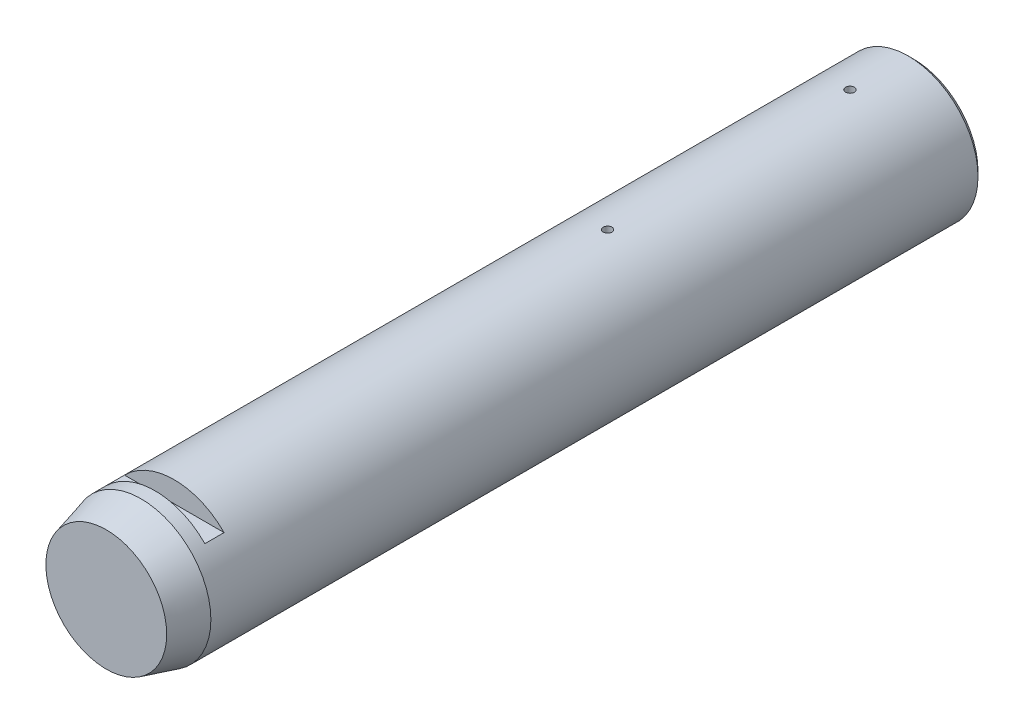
from build123d import *

# Parameters (mm, degrees)
ESQUISSE1_R                  = 40
EXTRUSION1_DEPTH             = 463
CHANFREIN1_SIZE              = 3
CHANFREIN2_SIZE              = 20
CHANFREIN2_SIZE2             = 5.358983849
TROU_TARAUD_M81_D            = 6.8
TROU_TARAUD_M81_DEPTH        = 180
TROU_TARAUD_M81_TIP          = 2.042926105
TROU_TARAUD_M82_D            = 6.8
TROU_TARAUD_M82_DEPTH        = 125
TROU_TARAUD_M82_TIP          = 2.042926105
ENL_V_MAT_EXTRU_1_REACH      = 473.991
ENL_V_MAT_EXTRU_1_END_RADIUS = 3.4
ESQUISSE6_R                  = 2.5
ENL_V_MAT_EXTRU_2_DEPTH      = 42
ENL_V_MAT_EXTRU_2_DEPTH_BACK = 42
ESQUISSE7_W                  = 11
ESQUISSE7_H                  = 17.34138166


with BuildPart() as part:
    # Esquisse1 → Extrusion1 (new body)
    with BuildSketch(Plane.XY):
        Circle(ESQUISSE1_R)
    extrude(amount=EXTRUSION1_DEPTH)

    # Chanfrein1
    chanfrein1_edges = [part.edges().sort_by_distance(p)[0] for p in [
        (-40, 0, 0),
    ]]
    chamfer(chanfrein1_edges, length=CHANFREIN1_SIZE)

    # Chanfrein2
    chanfrein2_edges = [part.edges().sort_by_distance(p)[0] for p in [
        (-40, 0, 463),
    ]]
    chanfrein2_side = [part.faces().sort_by_distance(p)[0] for p in [
        (-40, 0, 233),
    ]]
    chamfer(chanfrein2_edges, length=CHANFREIN2_SIZE, length2=CHANFREIN2_SIZE2, reference=chanfrein2_side[0])

    # Trou taraud_ M81
    with Locations(Plane(origin=(0, 0, 0), x_dir=(-1, 0, 0), z_dir=(0, 0, -1))):
        with Locations((0, 0)):
            Hole(TROU_TARAUD_M81_D / 2, depth=TROU_TARAUD_M81_DEPTH)
            with Locations((0, 0, -(TROU_TARAUD_M81_DEPTH + TROU_TARAUD_M81_TIP / 2))):  # 118° drill point
                Cone(0, TROU_TARAUD_M81_D / 2, TROU_TARAUD_M81_TIP, mode=Mode.SUBTRACT)

    # Trou taraud_ M82
    with Locations(Plane(origin=(0, 0, 0), x_dir=(-1, 0, 0), z_dir=(0, 0, -1))):
        with Locations((-25, 0), (25, 0)):
            Hole(TROU_TARAUD_M82_D / 2, depth=TROU_TARAUD_M82_DEPTH)
            with Locations((0, 0, -(TROU_TARAUD_M82_DEPTH + TROU_TARAUD_M82_TIP / 2))):  # 118° drill point
                Cone(0, TROU_TARAUD_M82_D / 2, TROU_TARAUD_M82_TIP, mode=Mode.SUBTRACT)

    # Enl_v. mat.-Extru.1: up to this cylinder (the profile starts outside it)
    enl_v_mat_extru_1_end = Plane(origin=(0, 0, 106), z_dir=(0, 0, -1)) * Cylinder(ENL_V_MAT_EXTRU_1_END_RADIUS, 1094.782, mode=Mode.PRIVATE)
    # Esquisse6 → Enl_v. mat.-Extru.1 (cut, up to the surface)
    with BuildSketch(Plane(origin=(0, 42.5, 0), x_dir=(-1, 0, 0), z_dir=(0, 1, 0)), mode=Mode.PRIVATE) as enl_v_mat_extru_1_sk1:
        with Locations(Location((0, 36.5, 0), (0, 0, 90))):
            Circle(ESQUISSE6_R)
    enl_v_mat_extru_1_tool1 = extrude(enl_v_mat_extru_1_sk1.sketch, amount=-ENL_V_MAT_EXTRU_1_REACH, mode=Mode.PRIVATE) - enl_v_mat_extru_1_end
    add(enl_v_mat_extru_1_tool1.solids().sort_by_distance((0, 42.5, 36.5))[0], mode=Mode.SUBTRACT)
    # Esquisse6 → Enl_v. mat.-Extru.1 (cut, up to the surface)
    with BuildSketch(Plane(origin=(0, 42.5, 0), x_dir=(-1, 0, 0), z_dir=(0, 1, 0)), mode=Mode.PRIVATE) as enl_v_mat_extru_1_sk2:
        with Locations(Location((0, 175.5, 0), (0, 0, 90))):
            Circle(ESQUISSE6_R)
    enl_v_mat_extru_1_tool2 = extrude(enl_v_mat_extru_1_sk2.sketch, amount=-ENL_V_MAT_EXTRU_1_REACH, mode=Mode.PRIVATE) - enl_v_mat_extru_1_end
    add(enl_v_mat_extru_1_tool2.solids().sort_by_distance((0, 42.5, 175.5))[0], mode=Mode.SUBTRACT)

    # Esquisse7 → Enl_v. mat.-Extru.2 (cut, two sides: drawn at the far end of the back side and taken through both)
    with BuildSketch(Plane(origin=(0, 0, 0), x_dir=(0, 0, -1), z_dir=(1, 0, 0)).offset(-ENL_V_MAT_EXTRU_2_DEPTH_BACK)):
        with Locations((-429.5, 36.67069083)):
            Rectangle(ESQUISSE7_W, ESQUISSE7_H)
    extrude(amount=ENL_V_MAT_EXTRU_2_DEPTH + ENL_V_MAT_EXTRU_2_DEPTH_BACK, mode=Mode.SUBTRACT)


solid = part.part
